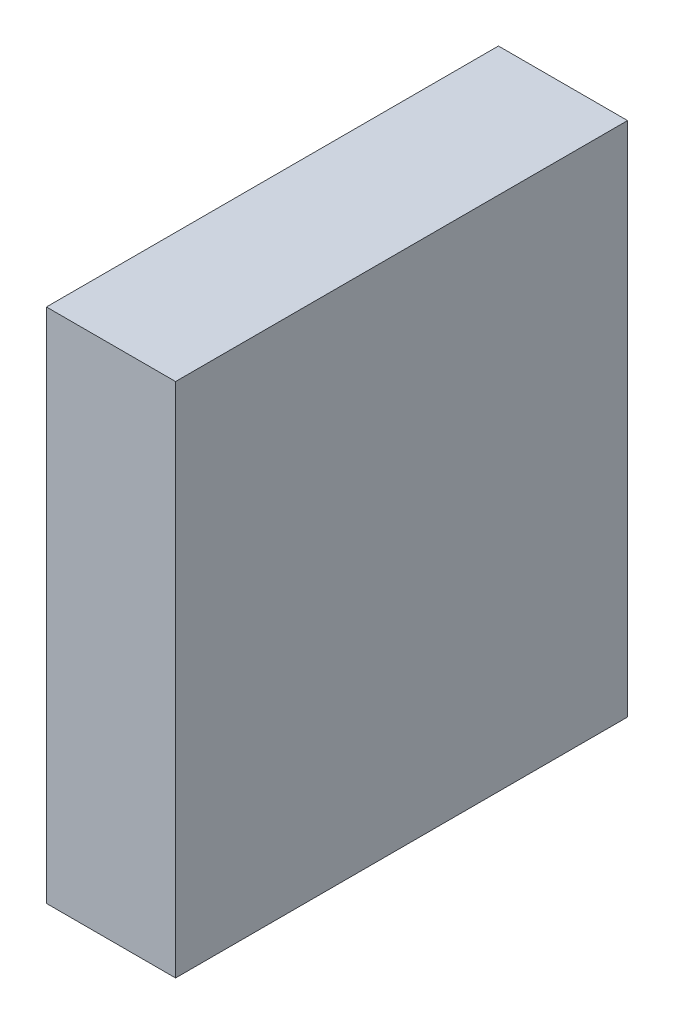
ISO-10303-21;
HEADER;
FILE_DESCRIPTION(('STEP AP214'),'2;1');
FILE_NAME('part.step','',(''),(''),'','','');
FILE_SCHEMA(('AUTOMOTIVE_DESIGN { 1 0 10303 214 1 1 1 1 }'));
ENDSEC;
DATA;
#1=APPLICATION_CONTEXT('core data for automotive mechanical design processes');
#2=APPLICATION_PROTOCOL_DEFINITION('international standard','automotive_design',2000,#1);
#3=PRODUCT_CONTEXT('',#1,'mechanical');
#4=PRODUCT('Part','Part','',(#3));
#5=PRODUCT_RELATED_PRODUCT_CATEGORY('part','',(#4));
#6=PRODUCT_DEFINITION_FORMATION('','',#4);
#7=PRODUCT_DEFINITION_CONTEXT('part definition',#1,'design');
#8=PRODUCT_DEFINITION('design','',#6,#7);
#9=PRODUCT_DEFINITION_SHAPE('','',#8);
#10=(LENGTH_UNIT() NAMED_UNIT(*) SI_UNIT(.MILLI.,.METRE.));
#11=(NAMED_UNIT(*) PLANE_ANGLE_UNIT() SI_UNIT($,.RADIAN.));
#12=(NAMED_UNIT(*) SI_UNIT($,.STERADIAN.) SOLID_ANGLE_UNIT());
#13=UNCERTAINTY_MEASURE_WITH_UNIT(LENGTH_MEASURE(1.E-05),#10,'distance_accuracy_value','');
#14=(GEOMETRIC_REPRESENTATION_CONTEXT(3) GLOBAL_UNCERTAINTY_ASSIGNED_CONTEXT((#13)) GLOBAL_UNIT_ASSIGNED_CONTEXT((#10,
#11,#12)) REPRESENTATION_CONTEXT('',''));
#15=CARTESIAN_POINT('',(0.,0.,0.));
#16=DIRECTION('',(0.,0.,1.));
#17=DIRECTION('',(1.,0.,0.));
#18=AXIS2_PLACEMENT_3D('',#15,#16,#17);
#19=CARTESIAN_POINT('',(0.,0.,7.));
#20=DIRECTION('',(1.,0.,0.));
#21=DIRECTION('',(0.,0.,-1.));
#22=AXIS2_PLACEMENT_3D('',#19,#20,#21);
#23=PLANE('',#22);
#24=DIRECTION('',(0.,-1.,0.));
#25=VECTOR('',#24,1.);
#26=CARTESIAN_POINT('',(0.,0.,0.));
#27=LINE('',#26,#25);
#28=CARTESIAN_POINT('',(0.,8.,0.));
#29=VERTEX_POINT('',#28);
#30=CARTESIAN_POINT('',(0.,0.,0.));
#31=VERTEX_POINT('',#30);
#32=EDGE_CURVE('E115',#29,#31,#27,.T.);
#33=ORIENTED_EDGE('',*,*,#32,.T.);
#34=DIRECTION('',(0.,0.,-1.));
#35=VECTOR('',#34,1.);
#36=CARTESIAN_POINT('',(0.,0.,7.));
#37=LINE('',#36,#35);
#38=CARTESIAN_POINT('',(0.,0.,7.));
#39=VERTEX_POINT('',#38);
#40=EDGE_CURVE('E11',#39,#31,#37,.T.);
#41=ORIENTED_EDGE('',*,*,#40,.F.);
#42=DIRECTION('',(0.,-1.,0.));
#43=VECTOR('',#42,1.);
#44=CARTESIAN_POINT('',(0.,0.,7.));
#45=LINE('',#44,#43);
#46=CARTESIAN_POINT('',(0.,8.,7.));
#47=VERTEX_POINT('',#46);
#48=EDGE_CURVE('E99',#47,#39,#45,.T.);
#49=ORIENTED_EDGE('',*,*,#48,.F.);
#50=DIRECTION('',(0.,0.,-1.));
#51=VECTOR('',#50,1.);
#52=CARTESIAN_POINT('',(0.,8.,7.));
#53=LINE('',#52,#51);
#54=EDGE_CURVE('E111',#47,#29,#53,.T.);
#55=ORIENTED_EDGE('',*,*,#54,.T.);
#56=EDGE_LOOP('',(#33,#41,#49,#55));
#57=FACE_BOUND('',#56,.T.);
#58=ADVANCED_FACE('F47',(#57),#23,.F.);
#59=CARTESIAN_POINT('',(0.,0.,7.));
#60=DIRECTION('',(0.,1.,0.));
#61=DIRECTION('',(0.,0.,1.));
#62=AXIS2_PLACEMENT_3D('',#59,#60,#61);
#63=PLANE('',#62);
#64=DIRECTION('',(1.,0.,0.));
#65=VECTOR('',#64,1.);
#66=CARTESIAN_POINT('',(0.,0.,0.));
#67=LINE('',#66,#65);
#68=CARTESIAN_POINT('',(2.,0.,0.));
#69=VERTEX_POINT('',#68);
#70=EDGE_CURVE('E104',#31,#69,#67,.T.);
#71=ORIENTED_EDGE('',*,*,#70,.T.);
#72=DIRECTION('',(0.,0.,-1.));
#73=VECTOR('',#72,1.);
#74=CARTESIAN_POINT('',(2.,0.,7.));
#75=LINE('',#74,#73);
#76=CARTESIAN_POINT('',(2.,0.,7.));
#77=VERTEX_POINT('',#76);
#78=EDGE_CURVE('E56',#77,#69,#75,.T.);
#79=ORIENTED_EDGE('',*,*,#78,.F.);
#80=DIRECTION('',(1.,0.,0.));
#81=VECTOR('',#80,1.);
#82=CARTESIAN_POINT('',(0.,0.,7.));
#83=LINE('',#82,#81);
#84=EDGE_CURVE('E94',#39,#77,#83,.T.);
#85=ORIENTED_EDGE('',*,*,#84,.F.);
#86=ORIENTED_EDGE('',*,*,#40,.T.);
#87=EDGE_LOOP('',(#71,#79,#85,#86));
#88=FACE_BOUND('',#87,.T.);
#89=ADVANCED_FACE('F103',(#88),#63,.F.);
#90=CARTESIAN_POINT('',(2.,0.,7.));
#91=DIRECTION('',(-1.,0.,0.));
#92=DIRECTION('',(0.,0.,1.));
#93=AXIS2_PLACEMENT_3D('',#90,#91,#92);
#94=PLANE('',#93);
#95=DIRECTION('',(0.,1.,0.));
#96=VECTOR('',#95,1.);
#97=CARTESIAN_POINT('',(2.,0.,0.));
#98=LINE('',#97,#96);
#99=CARTESIAN_POINT('',(2.,8.,0.));
#100=VERTEX_POINT('',#99);
#101=EDGE_CURVE('E81',#69,#100,#98,.T.);
#102=ORIENTED_EDGE('',*,*,#101,.T.);
#103=DIRECTION('',(0.,0.,-1.));
#104=VECTOR('',#103,1.);
#105=CARTESIAN_POINT('',(2.,8.,7.));
#106=LINE('',#105,#104);
#107=CARTESIAN_POINT('',(2.,8.,7.));
#108=VERTEX_POINT('',#107);
#109=EDGE_CURVE('E106',#108,#100,#106,.T.);
#110=ORIENTED_EDGE('',*,*,#109,.F.);
#111=DIRECTION('',(0.,1.,0.));
#112=VECTOR('',#111,1.);
#113=CARTESIAN_POINT('',(2.,0.,7.));
#114=LINE('',#113,#112);
#115=EDGE_CURVE('E97',#77,#108,#114,.T.);
#116=ORIENTED_EDGE('',*,*,#115,.F.);
#117=ORIENTED_EDGE('',*,*,#78,.T.);
#118=EDGE_LOOP('',(#102,#110,#116,#117));
#119=FACE_BOUND('',#118,.T.);
#120=ADVANCED_FACE('F107',(#119),#94,.F.);
#121=CARTESIAN_POINT('',(0.,8.,7.));
#122=DIRECTION('',(0.,-1.,0.));
#123=DIRECTION('',(0.,0.,-1.));
#124=AXIS2_PLACEMENT_3D('',#121,#122,#123);
#125=PLANE('',#124);
#126=DIRECTION('',(-1.,0.,0.));
#127=VECTOR('',#126,1.);
#128=CARTESIAN_POINT('',(0.,8.,0.));
#129=LINE('',#128,#127);
#130=EDGE_CURVE('E87',#100,#29,#129,.T.);
#131=ORIENTED_EDGE('',*,*,#130,.T.);
#132=ORIENTED_EDGE('',*,*,#54,.F.);
#133=DIRECTION('',(-1.,0.,0.));
#134=VECTOR('',#133,1.);
#135=CARTESIAN_POINT('',(0.,8.,7.));
#136=LINE('',#135,#134);
#137=EDGE_CURVE('E64',#108,#47,#136,.T.);
#138=ORIENTED_EDGE('',*,*,#137,.F.);
#139=ORIENTED_EDGE('',*,*,#109,.T.);
#140=EDGE_LOOP('',(#131,#132,#138,#139));
#141=FACE_BOUND('',#140,.T.);
#142=ADVANCED_FACE('F128',(#141),#125,.F.);
#143=CARTESIAN_POINT('',(0.,0.,7.));
#144=DIRECTION('',(0.,0.,-1.));
#145=DIRECTION('',(-1.,0.,0.));
#146=AXIS2_PLACEMENT_3D('',#143,#144,#145);
#147=PLANE('',#146);
#148=ORIENTED_EDGE('',*,*,#48,.T.);
#149=ORIENTED_EDGE('',*,*,#84,.T.);
#150=ORIENTED_EDGE('',*,*,#115,.T.);
#151=ORIENTED_EDGE('',*,*,#137,.T.);
#152=EDGE_LOOP('',(#148,#149,#150,#151));
#153=FACE_BOUND('',#152,.T.);
#154=ADVANCED_FACE('F95',(#153),#147,.F.);
#155=CARTESIAN_POINT('',(0.,0.,0.));
#156=DIRECTION('',(0.,0.,-1.));
#157=DIRECTION('',(-1.,0.,0.));
#158=AXIS2_PLACEMENT_3D('',#155,#156,#157);
#159=PLANE('',#158);
#160=ORIENTED_EDGE('',*,*,#32,.F.);
#161=ORIENTED_EDGE('',*,*,#130,.F.);
#162=ORIENTED_EDGE('',*,*,#101,.F.);
#163=ORIENTED_EDGE('',*,*,#70,.F.);
#164=EDGE_LOOP('',(#160,#161,#162,#163));
#165=FACE_BOUND('',#164,.T.);
#166=ADVANCED_FACE('F131',(#165),#159,.T.);
#167=CLOSED_SHELL('',(#58,#89,#120,#142,#154,#166));
#168=MANIFOLD_SOLID_BREP('B2',#167);
#169=ADVANCED_BREP_SHAPE_REPRESENTATION('',(#18,#168),#14);
#170=SHAPE_DEFINITION_REPRESENTATION(#9,#169);
ENDSEC;
END-ISO-10303-21;
